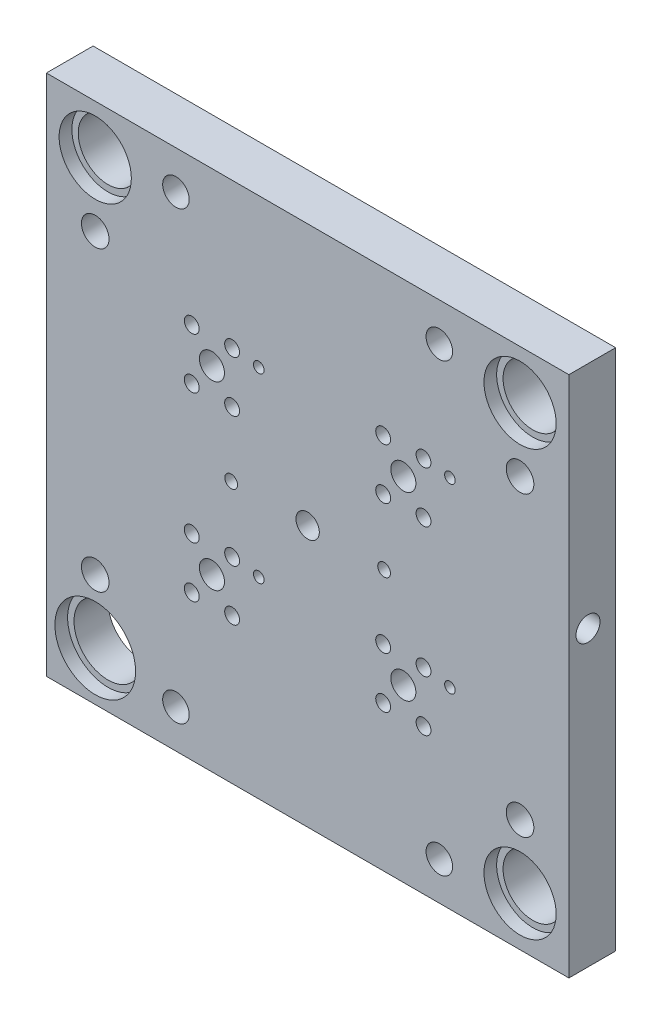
from build123d import *

# Parameters (mm, degrees)
ESQUISSE1_W                       = 246
ESQUISSE1_H                       = 246
EXTRUSION1_DEPTH                  = 22
ESQUISSE2_R                       = 14
EXTRUSION2_DEPTH                  = 176.333967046
R_P_TITION_LIN_AIRE1_COUNT        = 2
R_P_TITION_LIN_AIRE1_PITCH        = 200
R_P_TITION_LIN_AIRE1_COUNT_DIR2   = 2
R_P_TITION_LIN_AIRE1_PITCH_DIR2   = 200
ESQUISSE4_R                       = 17
EXTRUSION4_DEPTH                  = 6
R_P_TITION_LIN_AIRE3_COUNT        = 2
R_P_TITION_LIN_AIRE3_PITCH        = 200
R_P_TITION_LIN_AIRE3_COUNT_DIR2   = 2
R_P_TITION_LIN_AIRE3_PITCH_DIR2   = 200
ESQUISSE5_R                       = 3.5
EXTRUSION5_DEPTH                  = 176.333967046
ESQUISSE6_R                       = 3.5
EXTRUSION6_DEPTH                  = 176.333967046
ESQUISSE13_R                      = 5.5
EXTRUSION8_DEPTH                  = 176.333967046
ESQUISSE14_R                      = 3
EXTRUSION9_DEPTH                  = 176.333967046
ESQUISSE15_R                      = 6.5
EXTRUSION10_DEPTH                 = 176.333967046
R_P_TITION_LIN_AIRE9_COUNT        = 2
R_P_TITION_LIN_AIRE9_PITCH        = 200
R_P_TITION_LIN_AIRE9_COUNT_DIR2   = 2
R_P_TITION_LIN_AIRE9_PITCH_DIR2   = 140
ESQUISSE16_R                      = 6.25
EXTRUSION11_DEPTH                 = 176.333967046
R_P_TITION_LIN_AIRE10_COUNT       = 2
R_P_TITION_LIN_AIRE10_PITCH       = 124
R_P_TITION_LIN_AIRE10_COUNT_DIR2  = 2
R_P_TITION_LIN_AIRE10_PITCH_DIR2  = 210
ESQUISSE22_R                      = 5.9
EXTRUSION12_DEPTH                 = 176.333967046
ESQUISSE24_R                      = 4
EXTRUSION14_DEPTH                 = 276.914841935
ESQUISSE25_R                      = 5.65
EXTRUSION15_DEPTH                 = 15
EXTRUSION16_START                 = -15
ESQUISSE26_R                      = 5.65
EXTRUSION16_DEPTH                 = 15
ESQUISSE30_R                      = 19
EXTRUSION20_DEPTH                 = 6
ESQUISSE31_R                      = 16
EXTRUSION21_DEPTH                 = 176.333967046
ESQUISSE33_W                      = 15
ESQUISSE33_H                      = 42
EXTRUSION23_DEPTH                 = 7
CONG_1_R                          = 3
R_P_TITION_LIN_AIRE11_COUNT       = 2
R_P_TITION_LIN_AIRE11_PITCH       = 29
R_P_TITION_LIN_AIRE12_COUNT       = 2
R_P_TITION_LIN_AIRE12_PITCH       = 85.5
R_P_TITION_LIN_AIRE12_COUNT_DIR2  = 2
R_P_TITION_LIN_AIRE12_PITCH_DIR2  = 90
CONG_1_OF_R_P_TITION_LIN_AIRE12_R = 3
ESQUISSE36_R                      = 2.5
EXTRUSION24_DEPTH                 = 175.593814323
R_P_TITION_LIN_AIRE13_COUNT       = 2
R_P_TITION_LIN_AIRE13_PITCH       = 85.5
R_P_TITION_LIN_AIRE13_COUNT_DIR2  = 2
R_P_TITION_LIN_AIRE13_PITCH_DIR2  = 90


with BuildPart() as part:
    # Esquisse1 → Extrusion1 (new body)
    with BuildSketch(Plane.XY):
        Rectangle(ESQUISSE1_W, ESQUISSE1_H)
    extrude(amount=EXTRUSION1_DEPTH)

    # Esquisse2 → Extrusion2 (cut, through all)
    with BuildSketch(Plane.XY.offset(22)):
        with Locations((-100, 100)):
            Circle(ESQUISSE2_R)
    extrusion2 = extrude(amount=-EXTRUSION2_DEPTH, mode=Mode.SUBTRACT)

    # R_p_tition lin_aire1: Extrusion2 2 × 2
    with Locations(*[(i * R_P_TITION_LIN_AIRE1_PITCH, -j * R_P_TITION_LIN_AIRE1_PITCH_DIR2, 0) for i in range(R_P_TITION_LIN_AIRE1_COUNT) for j in range(R_P_TITION_LIN_AIRE1_COUNT_DIR2) if (i, j) != (0, 0)]):
        add(extrusion2, mode=Mode.SUBTRACT)

    # Esquisse4 → Extrusion4 (cut)
    with BuildSketch(Plane.XY.offset(22)):
        with Locations((-100, 100)):
            Circle(ESQUISSE4_R)
    extrusion4 = extrude(amount=-EXTRUSION4_DEPTH, mode=Mode.SUBTRACT)

    # R_p_tition lin_aire3: Extrusion4 2 × 2
    with Locations(*[(i * R_P_TITION_LIN_AIRE3_PITCH, -j * R_P_TITION_LIN_AIRE3_PITCH_DIR2, 0) for i in range(R_P_TITION_LIN_AIRE3_COUNT) for j in range(R_P_TITION_LIN_AIRE3_COUNT_DIR2) if (i, j) != (0, 0)]):
        add(extrusion4, mode=Mode.SUBTRACT)

    # Esquisse5 → Extrusion5 (cut, through all)
    with BuildSketch(Plane.XY.offset(22)):
        with Locations((-54.56, 54.56)):
            Circle(ESQUISSE5_R)
        with Locations((-54.56, 30.56)):
            Circle(ESQUISSE5_R)
        with Locations((-54.56, -30.56)):
            Circle(ESQUISSE5_R)
        with Locations((-54.56, -54.56)):
            Circle(ESQUISSE5_R)
        with Locations((54.56, 54.56)):
            Circle(ESQUISSE5_R)
        with Locations((54.56, 30.56)):
            Circle(ESQUISSE5_R)
        with Locations((54.56, -30.56)):
            Circle(ESQUISSE5_R)
        with Locations((54.56, -54.56)):
            Circle(ESQUISSE5_R)
    extrude(amount=-EXTRUSION5_DEPTH, mode=Mode.SUBTRACT)

    # Esquisse6 → Extrusion6 (cut, through all)
    with BuildSketch(Plane.XY.offset(22)):
        with Locations((-35.56, 54.56)):
            Circle(ESQUISSE6_R)
        with Locations((-35.56, 30.56)):
            Circle(ESQUISSE6_R)
        with Locations((-35.56, -30.56)):
            Circle(ESQUISSE6_R)
        with Locations((-35.56, -54.56)):
            Circle(ESQUISSE6_R)
        with Locations((35.56, -30.56)):
            Circle(ESQUISSE6_R)
        with Locations((35.56, -54.56)):
            Circle(ESQUISSE6_R)
        with Locations((35.56, 30.56)):
            Circle(ESQUISSE6_R)
        with Locations((35.56, 54.56)):
            Circle(ESQUISSE6_R)
    extrude(amount=-EXTRUSION6_DEPTH, mode=Mode.SUBTRACT)

    # Esquisse13 → Extrusion8 (cut, through all)
    with BuildSketch(Plane(origin=(0, 0, 0), x_dir=(-1, 0, 0), z_dir=(0, 0, -1))):
        Circle(ESQUISSE13_R)
    extrude(amount=-EXTRUSION8_DEPTH, mode=Mode.SUBTRACT)

    # Esquisse14 → Extrusion9 (cut, through all)
    with BuildSketch(Plane.XY.offset(22)):
        with Locations((-36, 0)):
            Circle(ESQUISSE14_R)
        with Locations((36, 0)):
            Circle(ESQUISSE14_R)
    extrude(amount=-EXTRUSION9_DEPTH, mode=Mode.SUBTRACT)

    # Esquisse15 → Extrusion10 (cut, through all)
    with BuildSketch(Plane.XY.offset(22)):
        with Locations((-100, 70)):
            Circle(ESQUISSE15_R)
    extrusion10 = extrude(amount=-EXTRUSION10_DEPTH, mode=Mode.SUBTRACT)

    # R_p_tition lin_aire9: Extrusion10 2 × 2
    with Locations(*[(i * R_P_TITION_LIN_AIRE9_PITCH, -j * R_P_TITION_LIN_AIRE9_PITCH_DIR2, 0) for i in range(R_P_TITION_LIN_AIRE9_COUNT) for j in range(R_P_TITION_LIN_AIRE9_COUNT_DIR2) if (i, j) != (0, 0)]):
        add(extrusion10, mode=Mode.SUBTRACT)

    # Esquisse16 → Extrusion11 (cut, through all)
    with BuildSketch(Plane(origin=(0, 0, 0), x_dir=(-1, 0, 0), z_dir=(0, 0, -1))):
        with Locations((-62, 105)):
            Circle(ESQUISSE16_R)
    extrusion11 = extrude(amount=-EXTRUSION11_DEPTH, mode=Mode.SUBTRACT)

    # R_p_tition lin_aire10: Extrusion11 2 × 2
    with Locations(*[(-i * R_P_TITION_LIN_AIRE10_PITCH, -j * R_P_TITION_LIN_AIRE10_PITCH_DIR2, 0) for i in range(R_P_TITION_LIN_AIRE10_COUNT) for j in range(R_P_TITION_LIN_AIRE10_COUNT_DIR2) if (i, j) != (0, 0)]):
        add(extrusion11, mode=Mode.SUBTRACT)

    # Esquisse22 → Extrusion12 (cut, through all)
    with BuildSketch(Plane(origin=(0, 0, 0), x_dir=(-1, 0, 0), z_dir=(0, 0, -1))):
        with Locations((-45.06, 42.56)):
            Circle(ESQUISSE22_R)
        with Locations((45.06, 42.56)):
            Circle(ESQUISSE22_R)
        with Locations((45.06, -42.56)):
            Circle(ESQUISSE22_R)
        with Locations((-45.06, -42.56)):
            Circle(ESQUISSE22_R)
    extrude(amount=-EXTRUSION12_DEPTH, mode=Mode.SUBTRACT)

    # Esquisse24 → Extrusion14 (cut, through all)
    with BuildSketch(Plane.ZY.offset(123)):
        with Locations(Location((13, 15, 0), (0, 0, 270))):
            Circle(ESQUISSE24_R)
    extrude(amount=-EXTRUSION14_DEPTH, mode=Mode.SUBTRACT)

    # Esquisse25 → Extrusion15 (cut)
    with BuildSketch(Plane(origin=(123, 0, 0), x_dir=(0, 0, -1), z_dir=(1, 0, 0))):
        with Locations(Location((-13, 15, 0), (0, 0, 90))):
            Circle(ESQUISSE25_R)
    extrude(amount=-EXTRUSION15_DEPTH, mode=Mode.SUBTRACT)

    # Esquisse26 → Extrusion16 (cut)
    with BuildSketch(Plane.ZY.offset(123).offset(EXTRUSION16_START)):
        with Locations(Location((13, 15, 0), (0, 0, 90))):
            Circle(ESQUISSE26_R)
    extrude(amount=EXTRUSION16_DEPTH, mode=Mode.SUBTRACT)

    # Esquisse30 → Extrusion20 (cut)
    with BuildSketch(Plane.XY.offset(22)):
        with Locations((-100, -100)):
            Circle(ESQUISSE30_R)
    extrude(amount=-EXTRUSION20_DEPTH, mode=Mode.SUBTRACT)

    # Esquisse31 → Extrusion21 (cut, through all)
    with BuildSketch(Plane.XY.offset(22)):
        with Locations((-100, -100)):
            Circle(ESQUISSE31_R)
    extrude(amount=-EXTRUSION21_DEPTH, mode=Mode.SUBTRACT)

    # Esquisse33 → Extrusion23 (cut)
    with BuildSketch(Plane(origin=(0, 0, 0), x_dir=(-1, 0, 0), z_dir=(0, 0, -1))):
        with Locations((-67, 56)):
            Rectangle(ESQUISSE33_W, ESQUISSE33_H)
    extrusion23 = extrude(amount=-EXTRUSION23_DEPTH, mode=Mode.SUBTRACT)

    # Cong_1
    cong_1_edges = [part.edges().sort_by_distance(p)[0] for p in [
        (74.5, 35, 3.5),
        (74.5, 77, 3.5),
        (59.5, 77, 3.5),
        (59.5, 35, 3.5),
    ]]
    fillet(cong_1_edges, radius=CONG_1_R)

    # Esquisse34 → Trou taraud_ M4x0.71 (revolve, cut)
    with BuildSketch(Plane(origin=(67, 70.5, 7), x_dir=(0, 1, 0), z_dir=(1, 0, 0))):
        Polygon((0, 0), (0, 12.491420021), (1.65, 11.5), (1.65, 0), align=None)
    trou_taraud_m4x0_71 = revolve(axis=Axis((67, 70.5, 0.65), (0, 0, 1)), mode=Mode.SUBTRACT)

    # R_p_tition lin_aire11: Trou taraud_ M4x0.71 ×2
    with Locations(*[(0, -i * R_P_TITION_LIN_AIRE11_PITCH, 0) for i in range(1, R_P_TITION_LIN_AIRE11_COUNT)]):
        add(trou_taraud_m4x0_71, mode=Mode.SUBTRACT)

    # R_p_tition lin_aire12: Extrusion23, Trou taraud_ M4x0.71 2 × 2
    with Locations(*[(-j * R_P_TITION_LIN_AIRE12_PITCH_DIR2, -i * R_P_TITION_LIN_AIRE12_PITCH, 0) for i in range(R_P_TITION_LIN_AIRE12_COUNT) for j in range(R_P_TITION_LIN_AIRE12_COUNT_DIR2) if (i, j) != (0, 0)]):
        add(extrusion23, mode=Mode.SUBTRACT)
        add(trou_taraud_m4x0_71, mode=Mode.SUBTRACT)

    # R_p_tition lin_aire12 copy 1 sketch → R_p_tition lin_aire12 copy 1 (revolve, cut)
    with BuildSketch(Plane(origin=(-23, 41.5, 7), x_dir=(0, 1, 0), z_dir=(1, 0, 0))):
        Polygon((0, 0), (0, 12.491420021), (1.65, 11.5), (1.65, 0), align=None)
    revolve(axis=Axis((-23, 41.5, 0.65), (0, 0, 1)), mode=Mode.SUBTRACT)

    # R_p_tition lin_aire12 copy 2 sketch → R_p_tition lin_aire12 copy 2 (revolve, cut)
    with BuildSketch(Plane(origin=(67, -44, 7), x_dir=(0, 1, 0), z_dir=(1, 0, 0))):
        Polygon((0, 0), (0, 12.491420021), (1.65, 11.5), (1.65, 0), align=None)
    revolve(axis=Axis((67, -44, 0.65), (0, 0, 1)), mode=Mode.SUBTRACT)

    # R_p_tition lin_aire12 copy 3 sketch → R_p_tition lin_aire12 copy 3 (revolve, cut)
    with BuildSketch(Plane(origin=(-23, -44, 7), x_dir=(0, 1, 0), z_dir=(1, 0, 0))):
        Polygon((0, 0), (0, 12.491420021), (1.65, 11.5), (1.65, 0), align=None)
    revolve(axis=Axis((-23, -44, 0.65), (0, 0, 1)), mode=Mode.SUBTRACT)

    # Cong_1 of R_p_tition lin_aire12
    cong_1_of_r_p_tition_lin_aire12_edges = [part.edges().sort_by_distance(p)[0] for p in [
        (-15.5, 35, 3.5),
        (-15.5, 77, 3.5),
        (-30.5, 77, 3.5),
        (-30.5, 35, 3.5),
        (74.5, -50.5, 3.5),
        (74.5, -8.5, 3.5),
        (59.5, -8.5, 3.5),
        (59.5, -50.5, 3.5),
        (-15.5, -50.5, 3.5),
        (-15.5, -8.5, 3.5),
        (-30.5, -8.5, 3.5),
        (-30.5, -50.5, 3.5),
    ]]
    fillet(cong_1_of_r_p_tition_lin_aire12_edges, radius=CONG_1_OF_R_P_TITION_LIN_AIRE12_R)

    # Esquisse36 → Extrusion24 (cut, through all)
    with BuildSketch(Plane(origin=(0, 0, 7), x_dir=(-1, 0, 0), z_dir=(0, 0, -1))):
        with Locations((-67, 53)):
            Circle(ESQUISSE36_R)
    extrusion24 = extrude(amount=-EXTRUSION24_DEPTH, mode=Mode.SUBTRACT)

    # R_p_tition lin_aire13: Extrusion24 2 × 2
    with Locations(*[(-j * R_P_TITION_LIN_AIRE13_PITCH_DIR2, -i * R_P_TITION_LIN_AIRE13_PITCH, 0) for i in range(R_P_TITION_LIN_AIRE13_COUNT) for j in range(R_P_TITION_LIN_AIRE13_COUNT_DIR2) if (i, j) != (0, 0)]):
        add(extrusion24, mode=Mode.SUBTRACT)


solid = part.part
